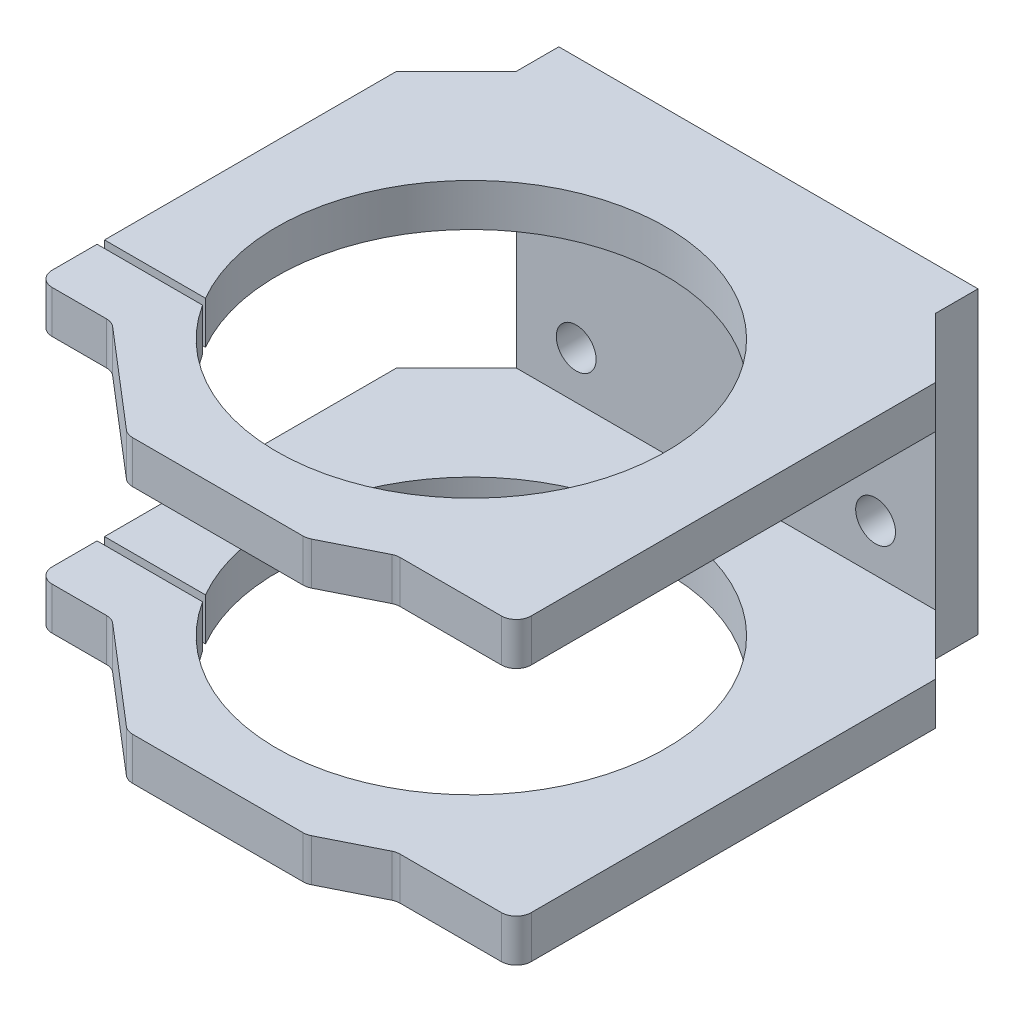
from build123d import *

# Parameters (mm, degrees)
SKETCH1_W            = 88.9
SKETCH1_H            = 63.5
EXTRUDE1_DEPTH       = 9.017
SKETCH2_R            = 4.22275
CUT_EXTRUDE1_DEPTH   = 56.363989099
EXTRUDE2_DEPTH       = 9.017
FILLET1_R            = 3.175
FILLET1_OF_MIRROR1_R = 3.175


with BuildPart() as part:
    # Sketch1 → Extrude1 (new body)
    with BuildSketch(Plane.XY):
        Rectangle(SKETCH1_W, SKETCH1_H)
    extrude(amount=EXTRUDE1_DEPTH)

    # Sketch2 → Cut-Extrude1 (cut, through all)
    with BuildSketch(Plane.XY.offset(9.017)):
        with Locations((-31.75, 12.7)):
            Circle(SKETCH2_R)
        with Locations(Location((31.75, 12.7, 0), (0, 0, 180))):
            Circle(SKETCH2_R)
        with Locations(Location((-31.75, -12.7, 0), (0, 0, 180))):
            Circle(SKETCH2_R)
        with Locations((31.75, -12.7)):
            Circle(SKETCH2_R)
    extrude(amount=-CUT_EXTRUDE1_DEPTH, mode=Mode.SUBTRACT)

    # Sketch3 → Extrude2 (add)
    with BuildSketch(Plane(origin=(0, 31.75, 0), x_dir=(-1, 0, 0), z_dir=(0, 1, 0))):
        with BuildLine():
            Line((-44.45, 9.017), (-57.15, 21.717))
            Line((-57.15, 21.717), (-57.15, 110.617))
            Line((-57.15, 110.617), (-31.75, 110.617))
            Line((-31.75, 110.617), (-19.05, 116.967))
            Line((-19.05, 116.967), (19.05, 116.967))
            Line((19.05, 116.967), (41.275, 97.917))
            Line((41.275, 97.917), (57.15, 97.917))
            Line((57.15, 97.917), (57.15, 85.217))
            Line((57.15, 85.217), (34.780382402, 85.217))
            ThreePointArc((34.780382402, 85.217), (-35.26791373, 41.549055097), (35.737863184, 83.6422))
            Line((35.737863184, 83.6422), (57.15, 83.6422))
            Line((57.15, 83.6422), (57.15, 21.717))
            Line((57.15, 21.717), (44.45, 9.017))
            Line((44.45, 9.017), (-44.45, 9.017))
        make_face()
    extrude2 = extrude(amount=-EXTRUDE2_DEPTH)

    # Fillet1
    fillet1_edges = [part.edges().sort_by_distance(p)[0] for p in [
        (57.15, 27.2415, 110.617),
        (31.75, 27.2415, 110.617),
        (19.05, 27.2415, 116.967),
        (-19.05, 27.2415, 116.967),
        (-41.275, 27.2415, 97.917),
        (-57.15, 27.2415, 97.917),
    ]]
    fillet(fillet1_edges, radius=FILLET1_R)

    # Mirror1: Extrude2 across plane
    add(extrude2.mirror(Plane.ZX))

    # Fillet1 of Mirror1
    fillet1_of_mirror1_edges = [part.edges().sort_by_distance(p)[0] for p in [
        (57.15, -27.2415, 110.617),
        (31.75, -27.2415, 110.617),
        (19.05, -27.2415, 116.967),
        (-19.05, -27.2415, 116.967),
        (-41.275, -27.2415, 97.917),
        (-57.15, -27.2415, 97.917),
    ]]
    fillet(fillet1_of_mirror1_edges, radius=FILLET1_OF_MIRROR1_R)


solid = part.part
